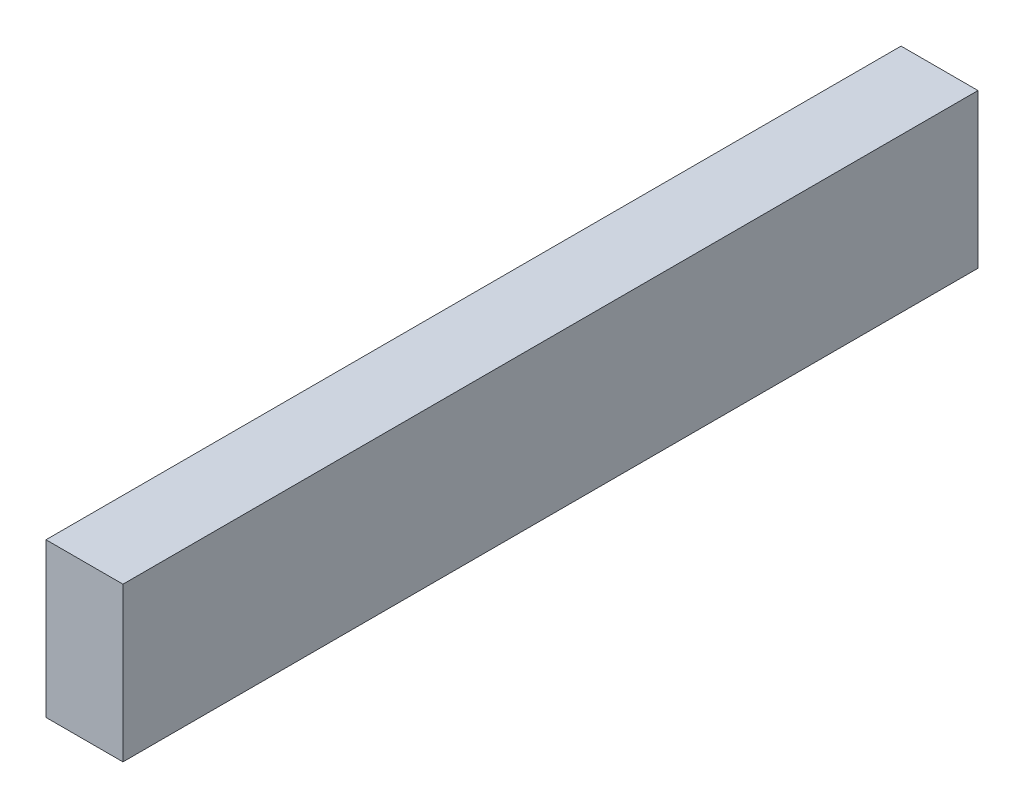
ISO-10303-21;
HEADER;
FILE_DESCRIPTION(('STEP AP214'),'2;1');
FILE_NAME('part.step','',(''),(''),'','','');
FILE_SCHEMA(('AUTOMOTIVE_DESIGN { 1 0 10303 214 1 1 1 1 }'));
ENDSEC;
DATA;
#1=APPLICATION_CONTEXT('core data for automotive mechanical design processes');
#2=APPLICATION_PROTOCOL_DEFINITION('international standard','automotive_design',2000,#1);
#3=PRODUCT_CONTEXT('',#1,'mechanical');
#4=PRODUCT('Part','Part','',(#3));
#5=PRODUCT_RELATED_PRODUCT_CATEGORY('part','',(#4));
#6=PRODUCT_DEFINITION_FORMATION('','',#4);
#7=PRODUCT_DEFINITION_CONTEXT('part definition',#1,'design');
#8=PRODUCT_DEFINITION('design','',#6,#7);
#9=PRODUCT_DEFINITION_SHAPE('','',#8);
#10=(LENGTH_UNIT() NAMED_UNIT(*) SI_UNIT(.MILLI.,.METRE.));
#11=(NAMED_UNIT(*) PLANE_ANGLE_UNIT() SI_UNIT($,.RADIAN.));
#12=(NAMED_UNIT(*) SI_UNIT($,.STERADIAN.) SOLID_ANGLE_UNIT());
#13=UNCERTAINTY_MEASURE_WITH_UNIT(LENGTH_MEASURE(1.E-05),#10,'distance_accuracy_value','');
#14=(GEOMETRIC_REPRESENTATION_CONTEXT(3) GLOBAL_UNCERTAINTY_ASSIGNED_CONTEXT((#13)) GLOBAL_UNIT_ASSIGNED_CONTEXT((#10,
#11,#12)) REPRESENTATION_CONTEXT('',''));
#15=CARTESIAN_POINT('',(0.,0.,0.));
#16=DIRECTION('',(0.,0.,1.));
#17=DIRECTION('',(1.,0.,0.));
#18=AXIS2_PLACEMENT_3D('',#15,#16,#17);
#19=CARTESIAN_POINT('',(10.,20.,222.2));
#20=DIRECTION('',(-1.,0.,0.));
#21=DIRECTION('',(0.,-1.,0.));
#22=AXIS2_PLACEMENT_3D('',#19,#20,#21);
#23=PLANE('',#22);
#24=DIRECTION('',(0.,1.,0.));
#25=VECTOR('',#24,1.);
#26=CARTESIAN_POINT('',(10.,20.,0.));
#27=LINE('',#26,#25);
#28=CARTESIAN_POINT('',(10.,-20.,0.));
#29=VERTEX_POINT('',#28);
#30=CARTESIAN_POINT('',(10.,20.,0.));
#31=VERTEX_POINT('',#30);
#32=EDGE_CURVE('E78',#29,#31,#27,.T.);
#33=ORIENTED_EDGE('',*,*,#32,.T.);
#34=DIRECTION('',(0.,0.,-1.));
#35=VECTOR('',#34,1.);
#36=CARTESIAN_POINT('',(10.,20.,222.2));
#37=LINE('',#36,#35);
#38=CARTESIAN_POINT('',(10.,20.,222.2));
#39=VERTEX_POINT('',#38);
#40=EDGE_CURVE('E11',#39,#31,#37,.T.);
#41=ORIENTED_EDGE('',*,*,#40,.F.);
#42=DIRECTION('',(0.,1.,0.));
#43=VECTOR('',#42,1.);
#44=CARTESIAN_POINT('',(10.,20.,222.2));
#45=LINE('',#44,#43);
#46=CARTESIAN_POINT('',(10.,-20.,222.2));
#47=VERTEX_POINT('',#46);
#48=EDGE_CURVE('E70',#47,#39,#45,.T.);
#49=ORIENTED_EDGE('',*,*,#48,.F.);
#50=DIRECTION('',(0.,0.,-1.));
#51=VECTOR('',#50,1.);
#52=CARTESIAN_POINT('',(10.,-20.,222.2));
#53=LINE('',#52,#51);
#54=EDGE_CURVE('E74',#47,#29,#53,.T.);
#55=ORIENTED_EDGE('',*,*,#54,.T.);
#56=EDGE_LOOP('',(#33,#41,#49,#55));
#57=FACE_BOUND('',#56,.T.);
#58=ADVANCED_FACE('F16',(#57),#23,.F.);
#59=CARTESIAN_POINT('',(-10.,20.,222.2));
#60=DIRECTION('',(0.,-1.,0.));
#61=DIRECTION('',(0.,0.,-1.));
#62=AXIS2_PLACEMENT_3D('',#59,#60,#61);
#63=PLANE('',#62);
#64=DIRECTION('',(-1.,0.,0.));
#65=VECTOR('',#64,1.);
#66=CARTESIAN_POINT('',(-10.,20.,0.));
#67=LINE('',#66,#65);
#68=CARTESIAN_POINT('',(-10.,20.,0.));
#69=VERTEX_POINT('',#68);
#70=EDGE_CURVE('E75',#31,#69,#67,.T.);
#71=ORIENTED_EDGE('',*,*,#70,.T.);
#72=DIRECTION('',(0.,0.,-1.));
#73=VECTOR('',#72,1.);
#74=CARTESIAN_POINT('',(-10.,20.,222.2));
#75=LINE('',#74,#73);
#76=CARTESIAN_POINT('',(-10.,20.,222.2));
#77=VERTEX_POINT('',#76);
#78=EDGE_CURVE('E24',#77,#69,#75,.T.);
#79=ORIENTED_EDGE('',*,*,#78,.F.);
#80=DIRECTION('',(-1.,0.,0.));
#81=VECTOR('',#80,1.);
#82=CARTESIAN_POINT('',(-10.,20.,222.2));
#83=LINE('',#82,#81);
#84=EDGE_CURVE('E62',#39,#77,#83,.T.);
#85=ORIENTED_EDGE('',*,*,#84,.F.);
#86=ORIENTED_EDGE('',*,*,#40,.T.);
#87=EDGE_LOOP('',(#71,#79,#85,#86));
#88=FACE_BOUND('',#87,.T.);
#89=ADVANCED_FACE('F69',(#88),#63,.F.);
#90=CARTESIAN_POINT('',(-10.,20.,222.2));
#91=DIRECTION('',(1.,0.,0.));
#92=DIRECTION('',(0.,1.,0.));
#93=AXIS2_PLACEMENT_3D('',#90,#91,#92);
#94=PLANE('',#93);
#95=DIRECTION('',(0.,-1.,0.));
#96=VECTOR('',#95,1.);
#97=CARTESIAN_POINT('',(-10.,20.,0.));
#98=LINE('',#97,#96);
#99=CARTESIAN_POINT('',(-10.,-20.,0.));
#100=VERTEX_POINT('',#99);
#101=EDGE_CURVE('E47',#69,#100,#98,.T.);
#102=ORIENTED_EDGE('',*,*,#101,.T.);
#103=DIRECTION('',(0.,0.,-1.));
#104=VECTOR('',#103,1.);
#105=CARTESIAN_POINT('',(-10.,-20.,222.2));
#106=LINE('',#105,#104);
#107=CARTESIAN_POINT('',(-10.,-20.,222.2));
#108=VERTEX_POINT('',#107);
#109=EDGE_CURVE('E71',#108,#100,#106,.T.);
#110=ORIENTED_EDGE('',*,*,#109,.F.);
#111=DIRECTION('',(0.,-1.,0.));
#112=VECTOR('',#111,1.);
#113=CARTESIAN_POINT('',(-10.,20.,222.2));
#114=LINE('',#113,#112);
#115=EDGE_CURVE('E65',#77,#108,#114,.T.);
#116=ORIENTED_EDGE('',*,*,#115,.F.);
#117=ORIENTED_EDGE('',*,*,#78,.T.);
#118=EDGE_LOOP('',(#102,#110,#116,#117));
#119=FACE_BOUND('',#118,.T.);
#120=ADVANCED_FACE('F73',(#119),#94,.F.);
#121=CARTESIAN_POINT('',(-10.,-20.,222.2));
#122=DIRECTION('',(0.,1.,0.));
#123=DIRECTION('',(0.,0.,1.));
#124=AXIS2_PLACEMENT_3D('',#121,#122,#123);
#125=PLANE('',#124);
#126=DIRECTION('',(1.,0.,0.));
#127=VECTOR('',#126,1.);
#128=CARTESIAN_POINT('',(-10.,-20.,0.));
#129=LINE('',#128,#127);
#130=EDGE_CURVE('E54',#100,#29,#129,.T.);
#131=ORIENTED_EDGE('',*,*,#130,.T.);
#132=ORIENTED_EDGE('',*,*,#54,.F.);
#133=DIRECTION('',(1.,0.,0.));
#134=VECTOR('',#133,1.);
#135=CARTESIAN_POINT('',(-10.,-20.,222.2));
#136=LINE('',#135,#134);
#137=EDGE_CURVE('E32',#108,#47,#136,.T.);
#138=ORIENTED_EDGE('',*,*,#137,.F.);
#139=ORIENTED_EDGE('',*,*,#109,.T.);
#140=EDGE_LOOP('',(#131,#132,#138,#139));
#141=FACE_BOUND('',#140,.T.);
#142=ADVANCED_FACE('F88',(#141),#125,.F.);
#143=CARTESIAN_POINT('',(0.,0.,222.2));
#144=DIRECTION('',(0.,0.,1.));
#145=DIRECTION('',(1.,0.,0.));
#146=AXIS2_PLACEMENT_3D('',#143,#144,#145);
#147=PLANE('',#146);
#148=ORIENTED_EDGE('',*,*,#48,.T.);
#149=ORIENTED_EDGE('',*,*,#84,.T.);
#150=ORIENTED_EDGE('',*,*,#115,.T.);
#151=ORIENTED_EDGE('',*,*,#137,.T.);
#152=EDGE_LOOP('',(#148,#149,#150,#151));
#153=FACE_BOUND('',#152,.T.);
#154=ADVANCED_FACE('F64',(#153),#147,.T.);
#155=CARTESIAN_POINT('',(0.,0.,0.));
#156=DIRECTION('',(0.,0.,1.));
#157=DIRECTION('',(1.,0.,0.));
#158=AXIS2_PLACEMENT_3D('',#155,#156,#157);
#159=PLANE('',#158);
#160=ORIENTED_EDGE('',*,*,#32,.F.);
#161=ORIENTED_EDGE('',*,*,#130,.F.);
#162=ORIENTED_EDGE('',*,*,#101,.F.);
#163=ORIENTED_EDGE('',*,*,#70,.F.);
#164=EDGE_LOOP('',(#160,#161,#162,#163));
#165=FACE_BOUND('',#164,.T.);
#166=ADVANCED_FACE('F90',(#165),#159,.F.);
#167=CLOSED_SHELL('',(#58,#89,#120,#142,#154,#166));
#168=MANIFOLD_SOLID_BREP('B1',#167);
#169=ADVANCED_BREP_SHAPE_REPRESENTATION('',(#18,#168),#14);
#170=SHAPE_DEFINITION_REPRESENTATION(#9,#169);
ENDSEC;
END-ISO-10303-21;
